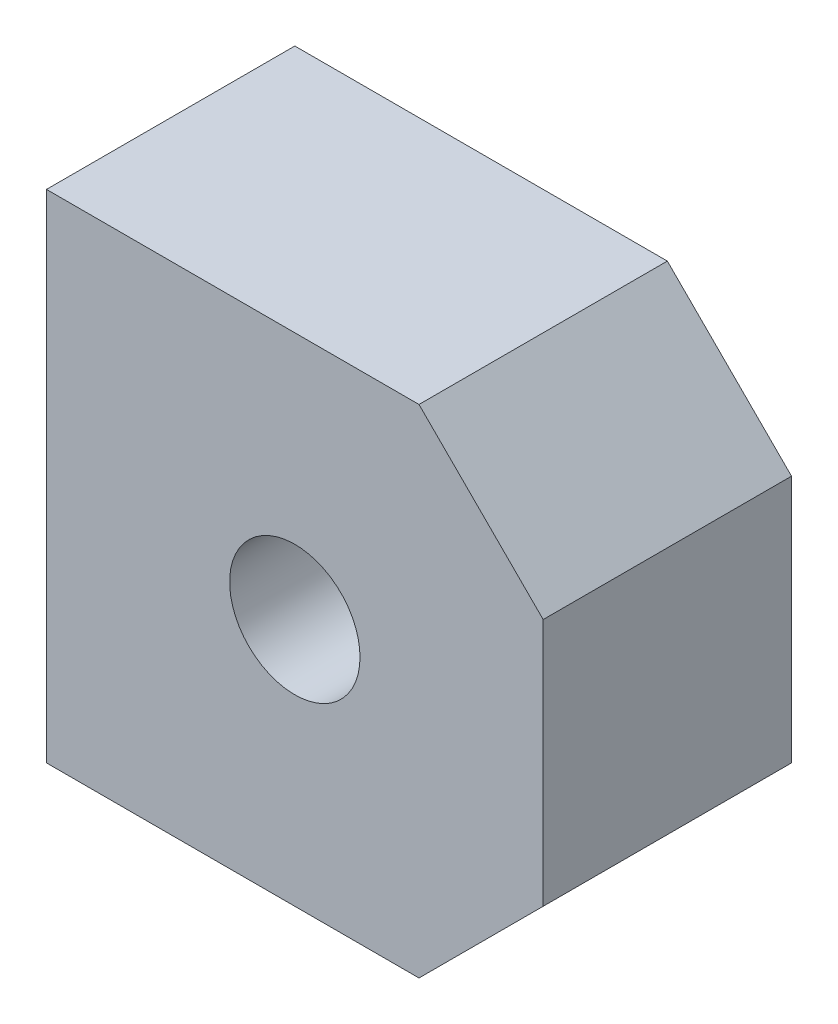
from build123d import *

# Parameters (mm, degrees)
ESQUISSE1_W                = 40
ESQUISSE1_H                = 40
EXTRUSION1_DEPTH           = 20
CHANFREIN1_SIZE            = 10
TROU_TARAUD_M12X1_51_D     = 10.5
TROU_TARAUD_M12X1_51_DEPTH = 28.5
TROU_TARAUD_M12X1_51_TIP   = 3.15451825


with BuildPart() as part:
    # Esquisse1 → Extrusion1 (new body)
    with BuildSketch(Plane.XY):
        with Locations((20, 20)):
            Rectangle(ESQUISSE1_W, ESQUISSE1_H)
    extrude(amount=EXTRUSION1_DEPTH)

    # Chanfrein1
    chanfrein1_edges = [part.edges().sort_by_distance(p)[0] for p in [
        (40, 40, 10),
        (40, 0, 10),
    ]]
    chamfer(chanfrein1_edges, length=CHANFREIN1_SIZE)

    # Trou taraud_ M12x1.51
    with Locations(Plane.XY.offset(20)):
        with Locations((20, 20)):
            Hole(TROU_TARAUD_M12X1_51_D / 2, depth=TROU_TARAUD_M12X1_51_DEPTH)
            with Locations((0, 0, -(TROU_TARAUD_M12X1_51_DEPTH + TROU_TARAUD_M12X1_51_TIP / 2))):  # 118° drill point
                Cone(0, TROU_TARAUD_M12X1_51_D / 2, TROU_TARAUD_M12X1_51_TIP, mode=Mode.SUBTRACT)


solid = part.part
